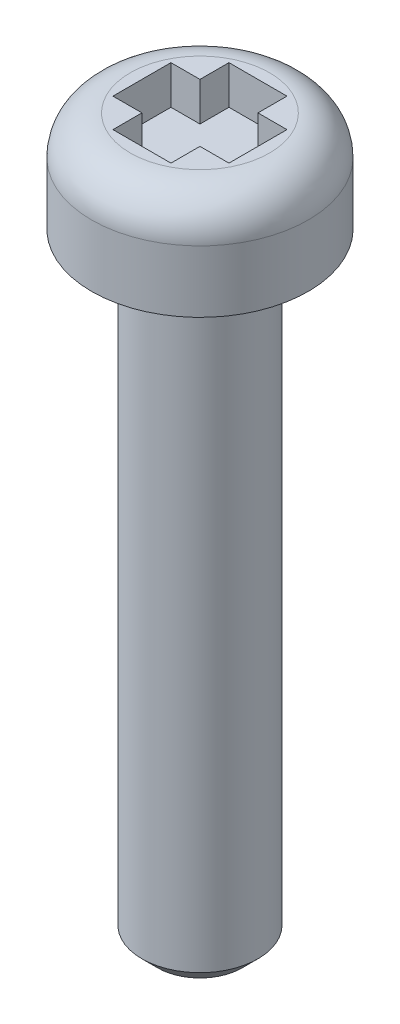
from build123d import *

# Parameters (mm, degrees)
SKETCH2_W               = 1.5
SKETCH2_H               = 3
CUT_EXTRUDE_THIN2_DEPTH = 1
CIRPATTERN1_COUNT       = 2
CIRPATTERN1_ANGLE       = 90
SKETCH3_R               = 1.5
BOSS_EXTRUDE1_DEPTH     = 16
FILLET1_R               = 0.4572
CHAMFER1_SIZE           = 0.4064


with BuildPart() as part:
    # Sketch1 → Base-Revolve (revolve)
    with BuildSketch(Plane.XY, mode=Mode.PRIVATE) as base_revolve_sk:
        with BuildLine():
            Line((2.8, 0), (0, 0))
            Line((0, 0), (0, 2.6))
            Line((0, 2.6), (1.8, 2.6))
            ThreePointArc((1.8, 2.6), (2.507106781, 2.307106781), (2.8, 1.6))
            Line((2.8, 1.6), (2.8, 0))
        make_face()
    revolve(base_revolve_sk.sketch.rotate(Axis((0, 11.592517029, 0), (0, -1, 0)), 90), axis=Axis((0, 11.592517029, 0), (0, -1, 0)))

    # Sketch2 → Cut-Extrude-Thin2 (cut)
    with BuildSketch(Plane(origin=(0, 2.6, 0), x_dir=(-1, 0, 0), z_dir=(0, 1, 0))):
        Rectangle(SKETCH2_W, SKETCH2_H)
    cut_extrude_thin2 = extrude(amount=-CUT_EXTRUDE_THIN2_DEPTH, mode=Mode.SUBTRACT)

    # CirPattern1: Cut-Extrude-Thin2 ×2 about axis
    cirpattern1_axis = Axis((0, 0, 0), (0, 1, 0))
    for i in range(1, CIRPATTERN1_COUNT):
        add(cut_extrude_thin2.rotate(cirpattern1_axis, i * CIRPATTERN1_ANGLE / (CIRPATTERN1_COUNT - 1)), mode=Mode.SUBTRACT)

    # Sketch3 → Boss-Extrude1 (add)
    with BuildSketch(Plane.XZ):
        with Locations(Location((0, 0, 0), (0, 0, 90))):
            Circle(SKETCH3_R)
    extrude(amount=BOSS_EXTRUDE1_DEPTH)

    # Fillet1
    fillet1_edges = [part.edges().sort_by_distance(p)[0] for p in [
        (0, 0, -1.5),
    ]]
    fillet(fillet1_edges, radius=FILLET1_R)

    # Chamfer1
    chamfer1_edges = [part.edges().sort_by_distance(p)[0] for p in [
        (0, -16, -1.5),
    ]]
    chamfer(chamfer1_edges, length=CHAMFER1_SIZE)


solid = part.part
